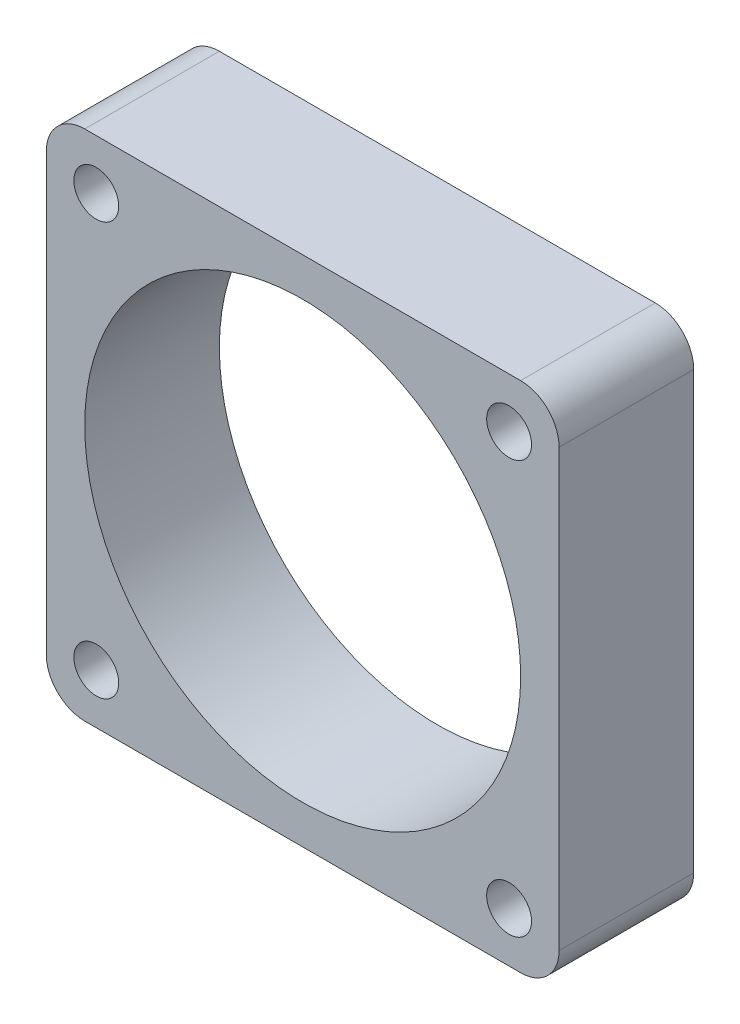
from build123d import *

# Parameters (mm, degrees)
EXTRUDE_1_DEPTH     = 10.5
SKETCH_2_R          = 1.75
CUT_EXTRUDE_1_DEPTH = 58.534772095
CUT_EXTRUDE_2_REACH = 59.535
SKETCH_3_R          = 17


with BuildPart() as part:
    # Sketch 1 → Extrude 1 (new body)
    with BuildSketch(Plane.XY):
        with BuildLine():
            Line((3, 0), (37, 0))
            ThreePointArc((37, 0), (39.121320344, 0.878679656), (40, 3))
            Line((40, 3), (40, 37))
            ThreePointArc((40, 37), (39.121320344, 39.121320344), (37, 40))
            Line((37, 40), (3, 40))
            ThreePointArc((3, 40), (0.878679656, 39.121320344), (0, 37))
            Line((0, 37), (0, 3))
            ThreePointArc((0, 3), (0.878679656, 0.878679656), (3, 0))
        make_face()
    extrude(amount=EXTRUDE_1_DEPTH)

    # Sketch 2 → Cut-Extrude 1 (cut, through all)
    with BuildSketch(Plane.XY.offset(10.5)):
        with Locations((3.9, 36.1)):
            Circle(SKETCH_2_R)
        with Locations((36.1, 36.1)):
            Circle(SKETCH_2_R)
        with Locations((3.9, 3.9)):
            Circle(SKETCH_2_R)
        with Locations((36.1, 3.9)):
            Circle(SKETCH_2_R)
    extrude(amount=-CUT_EXTRUDE_1_DEPTH, mode=Mode.SUBTRACT)

    # Sketch 3 → Cut-Extrude 2 (cut, up to next)
    with BuildSketch(Plane.XY.offset(10.5), mode=Mode.PRIVATE) as cut_extrude_2_sk1:
        with Locations((20, 20)):
            Circle(SKETCH_3_R)
    cut_extrude_2_tool1 = extrude(cut_extrude_2_sk1.sketch, amount=-CUT_EXTRUDE_2_REACH, mode=Mode.PRIVATE) & part.part
    add(cut_extrude_2_tool1.solids().sort_by_distance((20, 20, 10.5))[0], mode=Mode.SUBTRACT)


solid = part.part
